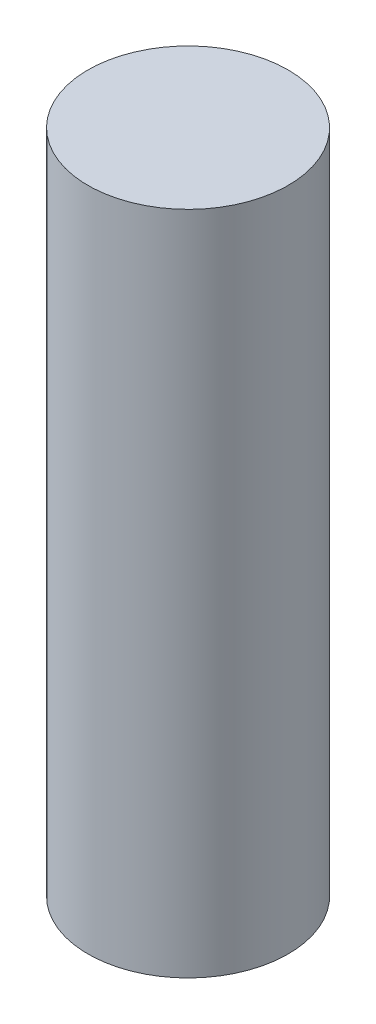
from build123d import *

# Parameters (mm, degrees)
SKETCH2_W = 16.75
SKETCH2_H = 111.4


with BuildPart() as part:
    # Sketch2 → Revolve1 (revolve)
    with BuildSketch(Plane.XY, mode=Mode.PRIVATE) as revolve1_sk:
        with Locations((-8.375, 55.7)):
            Rectangle(SKETCH2_W, SKETCH2_H)
    revolve(revolve1_sk.sketch.rotate(Axis((0, 0, 0), (0, 1, 0)), 270), axis=Axis((0, 0, 0), (0, 1, 0)))


solid = part.part
